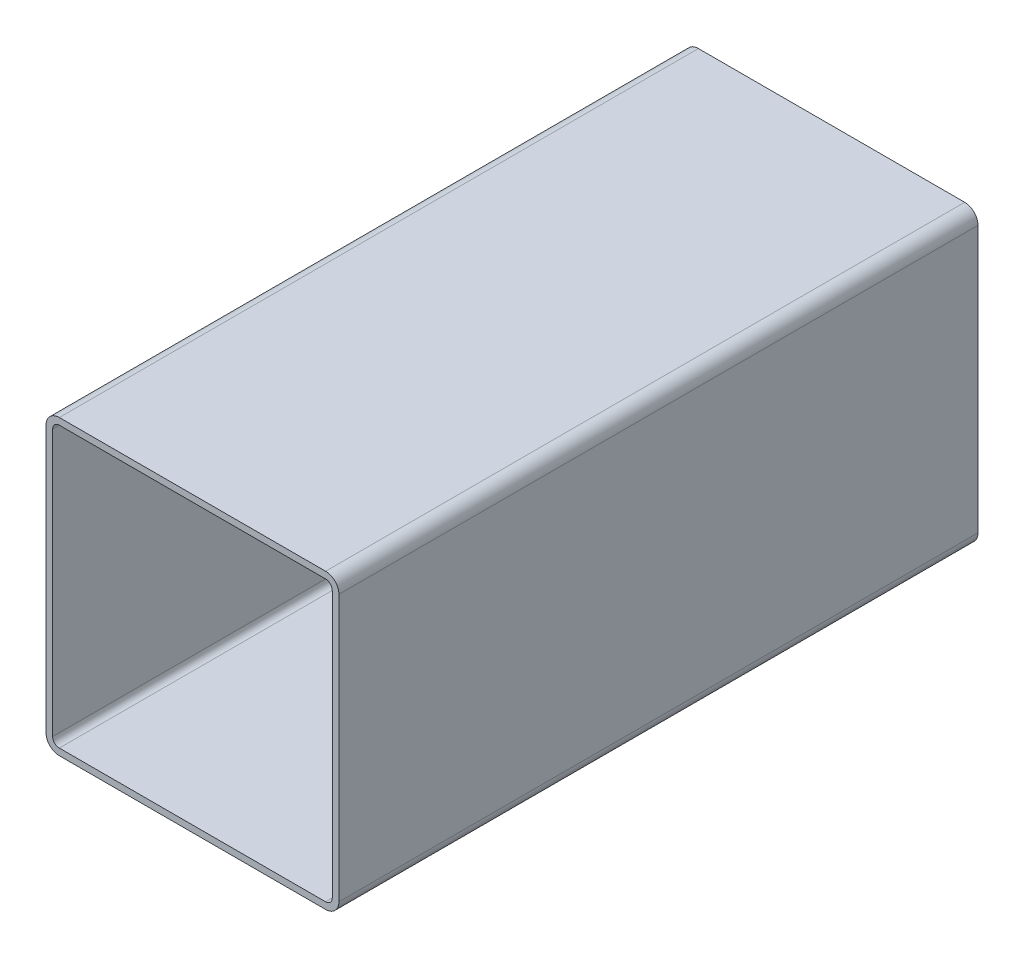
ISO-10303-21;
HEADER;
FILE_DESCRIPTION(('STEP AP214'),'2;1');
FILE_NAME('part.step','',(''),(''),'','','');
FILE_SCHEMA(('AUTOMOTIVE_DESIGN { 1 0 10303 214 1 1 1 1 }'));
ENDSEC;
DATA;
#1=APPLICATION_CONTEXT('core data for automotive mechanical design processes');
#2=APPLICATION_PROTOCOL_DEFINITION('international standard','automotive_design',2000,#1);
#3=PRODUCT_CONTEXT('',#1,'mechanical');
#4=PRODUCT('Part','Part','',(#3));
#5=PRODUCT_RELATED_PRODUCT_CATEGORY('part','',(#4));
#6=PRODUCT_DEFINITION_FORMATION('','',#4);
#7=PRODUCT_DEFINITION_CONTEXT('part definition',#1,'design');
#8=PRODUCT_DEFINITION('design','',#6,#7);
#9=PRODUCT_DEFINITION_SHAPE('','',#8);
#10=(LENGTH_UNIT() NAMED_UNIT(*) SI_UNIT(.MILLI.,.METRE.));
#11=(NAMED_UNIT(*) PLANE_ANGLE_UNIT() SI_UNIT($,.RADIAN.));
#12=(NAMED_UNIT(*) SI_UNIT($,.STERADIAN.) SOLID_ANGLE_UNIT());
#13=UNCERTAINTY_MEASURE_WITH_UNIT(LENGTH_MEASURE(1.E-05),#10,'distance_accuracy_value','');
#14=(GEOMETRIC_REPRESENTATION_CONTEXT(3) GLOBAL_UNCERTAINTY_ASSIGNED_CONTEXT((#13)) GLOBAL_UNIT_ASSIGNED_CONTEXT((#10,
#11,#12)) REPRESENTATION_CONTEXT('',''));
#15=CARTESIAN_POINT('',(0.,0.,0.));
#16=DIRECTION('',(0.,0.,1.));
#17=DIRECTION('',(1.,0.,0.));
#18=AXIS2_PLACEMENT_3D('',#15,#16,#17);
#19=CARTESIAN_POINT('',(6.80427050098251,134.105693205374,304.8));
#20=DIRECTION('',(0.,0.,1.));
#21=DIRECTION('',(1.,0.,0.));
#22=AXIS2_PLACEMENT_3D('',#19,#20,#21);
#23=PLANE('',#22);
#24=CARTESIAN_POINT('',(6.80427050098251,134.105693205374,304.8));
#25=DIRECTION('',(0.,0.,1.));
#26=DIRECTION('',(1.,0.,0.));
#27=AXIS2_PLACEMENT_3D('',#24,#25,#26);
#28=CIRCLE('',#27,6.35000000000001);
#29=CARTESIAN_POINT('',(6.80427050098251,140.455693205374,304.8));
#30=VERTEX_POINT('',#29);
#31=CARTESIAN_POINT('',(0.454270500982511,134.105693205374,304.8));
#32=VERTEX_POINT('',#31);
#33=EDGE_CURVE('E211',#30,#32,#28,.T.);
#34=ORIENTED_EDGE('',*,*,#33,.T.);
#35=DIRECTION('',(0.,-1.,0.));
#36=VECTOR('',#35,1.);
#37=CARTESIAN_POINT('',(0.454270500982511,7.10569320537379,304.8));
#38=LINE('',#37,#36);
#39=CARTESIAN_POINT('',(0.45427050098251,7.1056932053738,304.8));
#40=VERTEX_POINT('',#39);
#41=EDGE_CURVE('E214',#32,#40,#38,.T.);
#42=ORIENTED_EDGE('',*,*,#41,.T.);
#43=CARTESIAN_POINT('',(6.80427050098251,7.1056932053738,304.8));
#44=DIRECTION('',(0.,0.,1.));
#45=DIRECTION('',(1.,0.,0.));
#46=AXIS2_PLACEMENT_3D('',#43,#44,#45);
#47=CIRCLE('',#46,6.35);
#48=CARTESIAN_POINT('',(6.80427050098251,0.755693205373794,304.8));
#49=VERTEX_POINT('',#48);
#50=EDGE_CURVE('E217',#40,#49,#47,.T.);
#51=ORIENTED_EDGE('',*,*,#50,.T.);
#52=DIRECTION('',(1.,0.,0.));
#53=VECTOR('',#52,1.);
#54=CARTESIAN_POINT('',(133.804270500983,0.755693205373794,304.8));
#55=LINE('',#54,#53);
#56=CARTESIAN_POINT('',(133.804270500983,0.755693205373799,304.8));
#57=VERTEX_POINT('',#56);
#58=EDGE_CURVE('E219',#49,#57,#55,.T.);
#59=ORIENTED_EDGE('',*,*,#58,.T.);
#60=CARTESIAN_POINT('',(133.804270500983,7.1056932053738,304.8));
#61=DIRECTION('',(0.,0.,1.));
#62=DIRECTION('',(1.,0.,0.));
#63=AXIS2_PLACEMENT_3D('',#60,#61,#62);
#64=CIRCLE('',#63,6.35);
#65=CARTESIAN_POINT('',(140.154270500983,7.10569320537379,304.8));
#66=VERTEX_POINT('',#65);
#67=EDGE_CURVE('E221',#57,#66,#64,.T.);
#68=ORIENTED_EDGE('',*,*,#67,.T.);
#69=DIRECTION('',(0.,1.,0.));
#70=VECTOR('',#69,1.);
#71=CARTESIAN_POINT('',(140.154270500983,134.105693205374,304.8));
#72=LINE('',#71,#70);
#73=CARTESIAN_POINT('',(140.154270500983,134.105693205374,304.8));
#74=VERTEX_POINT('',#73);
#75=EDGE_CURVE('E223',#66,#74,#72,.T.);
#76=ORIENTED_EDGE('',*,*,#75,.T.);
#77=CARTESIAN_POINT('',(133.804270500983,134.105693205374,304.8));
#78=DIRECTION('',(0.,0.,1.));
#79=DIRECTION('',(1.,0.,0.));
#80=AXIS2_PLACEMENT_3D('',#77,#78,#79);
#81=CIRCLE('',#80,6.35000000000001);
#82=CARTESIAN_POINT('',(133.804270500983,140.455693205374,304.8));
#83=VERTEX_POINT('',#82);
#84=EDGE_CURVE('E225',#74,#83,#81,.T.);
#85=ORIENTED_EDGE('',*,*,#84,.T.);
#86=DIRECTION('',(-1.,0.,0.));
#87=VECTOR('',#86,1.);
#88=CARTESIAN_POINT('',(6.80427050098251,140.455693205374,304.8));
#89=LINE('',#88,#87);
#90=EDGE_CURVE('E227',#83,#30,#89,.T.);
#91=ORIENTED_EDGE('',*,*,#90,.T.);
#92=EDGE_LOOP('',(#34,#42,#51,#59,#68,#76,#85,#91));
#93=FACE_BOUND('',#92,.T.);
#94=DIRECTION('',(0.,-1.,0.));
#95=VECTOR('',#94,1.);
#96=CARTESIAN_POINT('',(3.62927050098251,7.10569320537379,304.8));
#97=LINE('',#96,#95);
#98=CARTESIAN_POINT('',(3.62927050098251,134.105693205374,304.8));
#99=VERTEX_POINT('',#98);
#100=CARTESIAN_POINT('',(3.62927050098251,7.10569320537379,304.8));
#101=VERTEX_POINT('',#100);
#102=EDGE_CURVE('E154',#99,#101,#97,.T.);
#103=ORIENTED_EDGE('',*,*,#102,.F.);
#104=CARTESIAN_POINT('',(6.80427050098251,134.105693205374,304.8));
#105=DIRECTION('',(0.,0.,1.));
#106=DIRECTION('',(1.,0.,0.));
#107=AXIS2_PLACEMENT_3D('',#104,#105,#106);
#108=CIRCLE('',#107,3.17500000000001);
#109=CARTESIAN_POINT('',(6.80427050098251,137.280693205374,304.8));
#110=VERTEX_POINT('',#109);
#111=EDGE_CURVE('E146',#110,#99,#108,.T.);
#112=ORIENTED_EDGE('',*,*,#111,.F.);
#113=DIRECTION('',(-1.,0.,0.));
#114=VECTOR('',#113,1.);
#115=CARTESIAN_POINT('',(6.80427050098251,137.280693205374,304.8));
#116=LINE('',#115,#114);
#117=CARTESIAN_POINT('',(133.804270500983,137.280693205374,304.8));
#118=VERTEX_POINT('',#117);
#119=EDGE_CURVE('E179',#118,#110,#116,.T.);
#120=ORIENTED_EDGE('',*,*,#119,.F.);
#121=CARTESIAN_POINT('',(133.804270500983,134.105693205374,304.8));
#122=DIRECTION('',(0.,0.,1.));
#123=DIRECTION('',(1.,0.,0.));
#124=AXIS2_PLACEMENT_3D('',#121,#122,#123);
#125=CIRCLE('',#124,3.175);
#126=CARTESIAN_POINT('',(136.979270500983,134.105693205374,304.8));
#127=VERTEX_POINT('',#126);
#128=EDGE_CURVE('E177',#127,#118,#125,.T.);
#129=ORIENTED_EDGE('',*,*,#128,.F.);
#130=DIRECTION('',(0.,1.,0.));
#131=VECTOR('',#130,1.);
#132=CARTESIAN_POINT('',(136.979270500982,134.105693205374,304.8));
#133=LINE('',#132,#131);
#134=CARTESIAN_POINT('',(136.979270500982,7.10569320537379,304.8));
#135=VERTEX_POINT('',#134);
#136=EDGE_CURVE('E175',#135,#127,#133,.T.);
#137=ORIENTED_EDGE('',*,*,#136,.F.);
#138=CARTESIAN_POINT('',(133.804270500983,7.1056932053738,304.8));
#139=DIRECTION('',(0.,0.,1.));
#140=DIRECTION('',(1.,0.,0.));
#141=AXIS2_PLACEMENT_3D('',#138,#139,#140);
#142=CIRCLE('',#141,3.17499999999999);
#143=CARTESIAN_POINT('',(133.804270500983,3.9306932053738,304.8));
#144=VERTEX_POINT('',#143);
#145=EDGE_CURVE('E173',#144,#135,#142,.T.);
#146=ORIENTED_EDGE('',*,*,#145,.F.);
#147=DIRECTION('',(1.,0.,0.));
#148=VECTOR('',#147,1.);
#149=CARTESIAN_POINT('',(133.804270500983,3.93069320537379,304.8));
#150=LINE('',#149,#148);
#151=CARTESIAN_POINT('',(6.80427050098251,3.93069320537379,304.8));
#152=VERTEX_POINT('',#151);
#153=EDGE_CURVE('E169',#152,#144,#150,.T.);
#154=ORIENTED_EDGE('',*,*,#153,.F.);
#155=CARTESIAN_POINT('',(6.80427050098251,7.1056932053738,304.8));
#156=DIRECTION('',(0.,0.,1.));
#157=DIRECTION('',(1.,0.,0.));
#158=AXIS2_PLACEMENT_3D('',#155,#156,#157);
#159=CIRCLE('',#158,3.175);
#160=EDGE_CURVE('E167',#101,#152,#159,.T.);
#161=ORIENTED_EDGE('',*,*,#160,.F.);
#162=EDGE_LOOP('',(#103,#112,#120,#129,#137,#146,#154,#161));
#163=FACE_BOUND('',#162,.T.);
#164=ADVANCED_FACE('F33',(#93,#163),#23,.T.);
#165=CARTESIAN_POINT('',(6.80427050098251,134.105693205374,0.));
#166=DIRECTION('',(0.,0.,1.));
#167=DIRECTION('',(1.,0.,0.));
#168=AXIS2_PLACEMENT_3D('',#165,#166,#167);
#169=PLANE('',#168);
#170=CARTESIAN_POINT('',(6.80427050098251,134.105693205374,0.));
#171=DIRECTION('',(0.,0.,1.));
#172=DIRECTION('',(1.,0.,0.));
#173=AXIS2_PLACEMENT_3D('',#170,#171,#172);
#174=CIRCLE('',#173,6.35000000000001);
#175=CARTESIAN_POINT('',(6.80427050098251,140.455693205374,0.));
#176=VERTEX_POINT('',#175);
#177=CARTESIAN_POINT('',(0.454270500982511,134.105693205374,0.));
#178=VERTEX_POINT('',#177);
#179=EDGE_CURVE('E162',#176,#178,#174,.T.);
#180=ORIENTED_EDGE('',*,*,#179,.F.);
#181=DIRECTION('',(-1.,0.,0.));
#182=VECTOR('',#181,1.);
#183=CARTESIAN_POINT('',(6.80427050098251,140.455693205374,0.));
#184=LINE('',#183,#182);
#185=CARTESIAN_POINT('',(133.804270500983,140.455693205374,0.));
#186=VERTEX_POINT('',#185);
#187=EDGE_CURVE('E215',#186,#176,#184,.T.);
#188=ORIENTED_EDGE('',*,*,#187,.F.);
#189=CARTESIAN_POINT('',(133.804270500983,134.105693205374,0.));
#190=DIRECTION('',(0.,0.,1.));
#191=DIRECTION('',(1.,0.,0.));
#192=AXIS2_PLACEMENT_3D('',#189,#190,#191);
#193=CIRCLE('',#192,6.35000000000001);
#194=CARTESIAN_POINT('',(140.154270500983,134.105693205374,0.));
#195=VERTEX_POINT('',#194);
#196=EDGE_CURVE('E242',#195,#186,#193,.T.);
#197=ORIENTED_EDGE('',*,*,#196,.F.);
#198=DIRECTION('',(0.,1.,0.));
#199=VECTOR('',#198,1.);
#200=CARTESIAN_POINT('',(140.154270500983,134.105693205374,0.));
#201=LINE('',#200,#199);
#202=CARTESIAN_POINT('',(140.154270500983,7.10569320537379,0.));
#203=VERTEX_POINT('',#202);
#204=EDGE_CURVE('E240',#203,#195,#201,.T.);
#205=ORIENTED_EDGE('',*,*,#204,.F.);
#206=CARTESIAN_POINT('',(133.804270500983,7.1056932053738,0.));
#207=DIRECTION('',(0.,0.,1.));
#208=DIRECTION('',(1.,0.,0.));
#209=AXIS2_PLACEMENT_3D('',#206,#207,#208);
#210=CIRCLE('',#209,6.35);
#211=CARTESIAN_POINT('',(133.804270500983,0.755693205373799,0.));
#212=VERTEX_POINT('',#211);
#213=EDGE_CURVE('E238',#212,#203,#210,.T.);
#214=ORIENTED_EDGE('',*,*,#213,.F.);
#215=DIRECTION('',(1.,0.,0.));
#216=VECTOR('',#215,1.);
#217=CARTESIAN_POINT('',(133.804270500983,0.755693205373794,0.));
#218=LINE('',#217,#216);
#219=CARTESIAN_POINT('',(6.80427050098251,0.755693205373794,0.));
#220=VERTEX_POINT('',#219);
#221=EDGE_CURVE('E236',#220,#212,#218,.T.);
#222=ORIENTED_EDGE('',*,*,#221,.F.);
#223=CARTESIAN_POINT('',(6.80427050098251,7.1056932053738,0.));
#224=DIRECTION('',(0.,0.,1.));
#225=DIRECTION('',(1.,0.,0.));
#226=AXIS2_PLACEMENT_3D('',#223,#224,#225);
#227=CIRCLE('',#226,6.35);
#228=CARTESIAN_POINT('',(0.45427050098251,7.1056932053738,0.));
#229=VERTEX_POINT('',#228);
#230=EDGE_CURVE('E234',#229,#220,#227,.T.);
#231=ORIENTED_EDGE('',*,*,#230,.F.);
#232=DIRECTION('',(0.,-1.,0.));
#233=VECTOR('',#232,1.);
#234=CARTESIAN_POINT('',(0.454270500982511,7.10569320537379,0.));
#235=LINE('',#234,#233);
#236=EDGE_CURVE('E232',#178,#229,#235,.T.);
#237=ORIENTED_EDGE('',*,*,#236,.F.);
#238=EDGE_LOOP('',(#180,#188,#197,#205,#214,#222,#231,#237));
#239=FACE_BOUND('',#238,.T.);
#240=CARTESIAN_POINT('',(6.80427050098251,134.105693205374,0.));
#241=DIRECTION('',(0.,0.,1.));
#242=DIRECTION('',(1.,0.,0.));
#243=AXIS2_PLACEMENT_3D('',#240,#241,#242);
#244=CIRCLE('',#243,3.17500000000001);
#245=CARTESIAN_POINT('',(6.80427050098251,137.280693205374,0.));
#246=VERTEX_POINT('',#245);
#247=CARTESIAN_POINT('',(3.62927050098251,134.105693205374,0.));
#248=VERTEX_POINT('',#247);
#249=EDGE_CURVE('E56',#246,#248,#244,.T.);
#250=ORIENTED_EDGE('',*,*,#249,.T.);
#251=DIRECTION('',(0.,-1.,0.));
#252=VECTOR('',#251,1.);
#253=CARTESIAN_POINT('',(3.62927050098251,7.10569320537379,0.));
#254=LINE('',#253,#252);
#255=CARTESIAN_POINT('',(3.62927050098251,7.10569320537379,0.));
#256=VERTEX_POINT('',#255);
#257=EDGE_CURVE('E161',#248,#256,#254,.T.);
#258=ORIENTED_EDGE('',*,*,#257,.T.);
#259=CARTESIAN_POINT('',(6.80427050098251,7.1056932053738,0.));
#260=DIRECTION('',(0.,0.,1.));
#261=DIRECTION('',(1.,0.,0.));
#262=AXIS2_PLACEMENT_3D('',#259,#260,#261);
#263=CIRCLE('',#262,3.175);
#264=CARTESIAN_POINT('',(6.80427050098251,3.93069320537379,0.));
#265=VERTEX_POINT('',#264);
#266=EDGE_CURVE('E183',#256,#265,#263,.T.);
#267=ORIENTED_EDGE('',*,*,#266,.T.);
#268=DIRECTION('',(1.,0.,0.));
#269=VECTOR('',#268,1.);
#270=CARTESIAN_POINT('',(133.804270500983,3.93069320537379,0.));
#271=LINE('',#270,#269);
#272=CARTESIAN_POINT('',(133.804270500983,3.9306932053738,0.));
#273=VERTEX_POINT('',#272);
#274=EDGE_CURVE('E186',#265,#273,#271,.T.);
#275=ORIENTED_EDGE('',*,*,#274,.T.);
#276=CARTESIAN_POINT('',(133.804270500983,7.1056932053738,0.));
#277=DIRECTION('',(0.,0.,1.));
#278=DIRECTION('',(1.,0.,0.));
#279=AXIS2_PLACEMENT_3D('',#276,#277,#278);
#280=CIRCLE('',#279,3.17499999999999);
#281=CARTESIAN_POINT('',(136.979270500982,7.10569320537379,0.));
#282=VERTEX_POINT('',#281);
#283=EDGE_CURVE('E189',#273,#282,#280,.T.);
#284=ORIENTED_EDGE('',*,*,#283,.T.);
#285=DIRECTION('',(0.,1.,0.));
#286=VECTOR('',#285,1.);
#287=CARTESIAN_POINT('',(136.979270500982,134.105693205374,0.));
#288=LINE('',#287,#286);
#289=CARTESIAN_POINT('',(136.979270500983,134.105693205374,0.));
#290=VERTEX_POINT('',#289);
#291=EDGE_CURVE('E192',#282,#290,#288,.T.);
#292=ORIENTED_EDGE('',*,*,#291,.T.);
#293=CARTESIAN_POINT('',(133.804270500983,134.105693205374,0.));
#294=DIRECTION('',(0.,0.,1.));
#295=DIRECTION('',(1.,0.,0.));
#296=AXIS2_PLACEMENT_3D('',#293,#294,#295);
#297=CIRCLE('',#296,3.175);
#298=CARTESIAN_POINT('',(133.804270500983,137.280693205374,0.));
#299=VERTEX_POINT('',#298);
#300=EDGE_CURVE('E195',#290,#299,#297,.T.);
#301=ORIENTED_EDGE('',*,*,#300,.T.);
#302=DIRECTION('',(-1.,0.,0.));
#303=VECTOR('',#302,1.);
#304=CARTESIAN_POINT('',(6.80427050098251,137.280693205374,0.));
#305=LINE('',#304,#303);
#306=EDGE_CURVE('E155',#299,#246,#305,.T.);
#307=ORIENTED_EDGE('',*,*,#306,.T.);
#308=EDGE_LOOP('',(#250,#258,#267,#275,#284,#292,#301,#307));
#309=FACE_BOUND('',#308,.T.);
#310=ADVANCED_FACE('F272',(#239,#309),#169,.F.);
#311=CARTESIAN_POINT('',(6.80427050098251,134.105693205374,304.8));
#312=DIRECTION('',(0.,0.,-1.));
#313=DIRECTION('',(-1.,0.,0.));
#314=AXIS2_PLACEMENT_3D('',#311,#312,#313);
#315=CYLINDRICAL_SURFACE('',#314,6.35000000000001);
#316=ORIENTED_EDGE('',*,*,#179,.T.);
#317=DIRECTION('',(0.,0.,-1.));
#318=VECTOR('',#317,1.);
#319=CARTESIAN_POINT('',(0.454270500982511,134.105693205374,304.8));
#320=LINE('',#319,#318);
#321=EDGE_CURVE('E11',#32,#178,#320,.T.);
#322=ORIENTED_EDGE('',*,*,#321,.F.);
#323=ORIENTED_EDGE('',*,*,#33,.F.);
#324=DIRECTION('',(0.,0.,-1.));
#325=VECTOR('',#324,1.);
#326=CARTESIAN_POINT('',(6.80427050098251,140.455693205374,304.8));
#327=LINE('',#326,#325);
#328=EDGE_CURVE('E229',#30,#176,#327,.T.);
#329=ORIENTED_EDGE('',*,*,#328,.T.);
#330=EDGE_LOOP('',(#316,#322,#323,#329));
#331=FACE_BOUND('',#330,.T.);
#332=ADVANCED_FACE('F35',(#331),#315,.T.);
#333=CARTESIAN_POINT('',(0.454270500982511,7.10569320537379,304.8));
#334=DIRECTION('',(1.,0.,0.));
#335=DIRECTION('',(0.,0.,-1.));
#336=AXIS2_PLACEMENT_3D('',#333,#334,#335);
#337=PLANE('',#336);
#338=ORIENTED_EDGE('',*,*,#236,.T.);
#339=DIRECTION('',(0.,0.,-1.));
#340=VECTOR('',#339,1.);
#341=CARTESIAN_POINT('',(0.45427050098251,7.1056932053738,304.8));
#342=LINE('',#341,#340);
#343=EDGE_CURVE('E41',#40,#229,#342,.T.);
#344=ORIENTED_EDGE('',*,*,#343,.F.);
#345=ORIENTED_EDGE('',*,*,#41,.F.);
#346=ORIENTED_EDGE('',*,*,#321,.T.);
#347=EDGE_LOOP('',(#338,#344,#345,#346));
#348=FACE_BOUND('',#347,.T.);
#349=ADVANCED_FACE('F289',(#348),#337,.F.);
#350=CARTESIAN_POINT('',(6.80427050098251,7.1056932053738,304.8));
#351=DIRECTION('',(0.,0.,-1.));
#352=DIRECTION('',(-1.,0.,0.));
#353=AXIS2_PLACEMENT_3D('',#350,#351,#352);
#354=CYLINDRICAL_SURFACE('',#353,6.35);
#355=ORIENTED_EDGE('',*,*,#230,.T.);
#356=DIRECTION('',(0.,0.,-1.));
#357=VECTOR('',#356,1.);
#358=CARTESIAN_POINT('',(6.80427050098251,0.755693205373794,304.8));
#359=LINE('',#358,#357);
#360=EDGE_CURVE('E259',#49,#220,#359,.T.);
#361=ORIENTED_EDGE('',*,*,#360,.F.);
#362=ORIENTED_EDGE('',*,*,#50,.F.);
#363=ORIENTED_EDGE('',*,*,#343,.T.);
#364=EDGE_LOOP('',(#355,#361,#362,#363));
#365=FACE_BOUND('',#364,.T.);
#366=ADVANCED_FACE('F266',(#365),#354,.T.);
#367=CARTESIAN_POINT('',(133.804270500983,0.755693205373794,304.8));
#368=DIRECTION('',(0.,1.,0.));
#369=DIRECTION('',(0.,0.,1.));
#370=AXIS2_PLACEMENT_3D('',#367,#368,#369);
#371=PLANE('',#370);
#372=ORIENTED_EDGE('',*,*,#221,.T.);
#373=DIRECTION('',(0.,0.,-1.));
#374=VECTOR('',#373,1.);
#375=CARTESIAN_POINT('',(133.804270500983,0.755693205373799,304.8));
#376=LINE('',#375,#374);
#377=EDGE_CURVE('E256',#57,#212,#376,.T.);
#378=ORIENTED_EDGE('',*,*,#377,.F.);
#379=ORIENTED_EDGE('',*,*,#58,.F.);
#380=ORIENTED_EDGE('',*,*,#360,.T.);
#381=EDGE_LOOP('',(#372,#378,#379,#380));
#382=FACE_BOUND('',#381,.T.);
#383=ADVANCED_FACE('F278',(#382),#371,.F.);
#384=CARTESIAN_POINT('',(133.804270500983,7.1056932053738,304.8));
#385=DIRECTION('',(0.,0.,-1.));
#386=DIRECTION('',(-1.,0.,0.));
#387=AXIS2_PLACEMENT_3D('',#384,#385,#386);
#388=CYLINDRICAL_SURFACE('',#387,6.35);
#389=ORIENTED_EDGE('',*,*,#213,.T.);
#390=DIRECTION('',(0.,0.,-1.));
#391=VECTOR('',#390,1.);
#392=CARTESIAN_POINT('',(140.154270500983,7.10569320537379,304.8));
#393=LINE('',#392,#391);
#394=EDGE_CURVE('E253',#66,#203,#393,.T.);
#395=ORIENTED_EDGE('',*,*,#394,.F.);
#396=ORIENTED_EDGE('',*,*,#67,.F.);
#397=ORIENTED_EDGE('',*,*,#377,.T.);
#398=EDGE_LOOP('',(#389,#395,#396,#397));
#399=FACE_BOUND('',#398,.T.);
#400=ADVANCED_FACE('F282',(#399),#388,.T.);
#401=CARTESIAN_POINT('',(140.154270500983,134.105693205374,304.8));
#402=DIRECTION('',(-1.,0.,0.));
#403=DIRECTION('',(0.,0.,1.));
#404=AXIS2_PLACEMENT_3D('',#401,#402,#403);
#405=PLANE('',#404);
#406=ORIENTED_EDGE('',*,*,#204,.T.);
#407=DIRECTION('',(0.,0.,-1.));
#408=VECTOR('',#407,1.);
#409=CARTESIAN_POINT('',(140.154270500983,134.105693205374,304.8));
#410=LINE('',#409,#408);
#411=EDGE_CURVE('E250',#74,#195,#410,.T.);
#412=ORIENTED_EDGE('',*,*,#411,.F.);
#413=ORIENTED_EDGE('',*,*,#75,.F.);
#414=ORIENTED_EDGE('',*,*,#394,.T.);
#415=EDGE_LOOP('',(#406,#412,#413,#414));
#416=FACE_BOUND('',#415,.T.);
#417=ADVANCED_FACE('F302',(#416),#405,.F.);
#418=CARTESIAN_POINT('',(133.804270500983,134.105693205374,304.8));
#419=DIRECTION('',(0.,0.,-1.));
#420=DIRECTION('',(-1.,0.,0.));
#421=AXIS2_PLACEMENT_3D('',#418,#419,#420);
#422=CYLINDRICAL_SURFACE('',#421,6.35000000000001);
#423=ORIENTED_EDGE('',*,*,#196,.T.);
#424=DIRECTION('',(0.,0.,-1.));
#425=VECTOR('',#424,1.);
#426=CARTESIAN_POINT('',(133.804270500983,140.455693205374,304.8));
#427=LINE('',#426,#425);
#428=EDGE_CURVE('E247',#83,#186,#427,.T.);
#429=ORIENTED_EDGE('',*,*,#428,.F.);
#430=ORIENTED_EDGE('',*,*,#84,.F.);
#431=ORIENTED_EDGE('',*,*,#411,.T.);
#432=EDGE_LOOP('',(#423,#429,#430,#431));
#433=FACE_BOUND('',#432,.T.);
#434=ADVANCED_FACE('F300',(#433),#422,.T.);
#435=CARTESIAN_POINT('',(6.80427050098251,140.455693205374,304.8));
#436=DIRECTION('',(0.,-1.,0.));
#437=DIRECTION('',(0.,0.,-1.));
#438=AXIS2_PLACEMENT_3D('',#435,#436,#437);
#439=PLANE('',#438);
#440=ORIENTED_EDGE('',*,*,#187,.T.);
#441=ORIENTED_EDGE('',*,*,#328,.F.);
#442=ORIENTED_EDGE('',*,*,#90,.F.);
#443=ORIENTED_EDGE('',*,*,#428,.T.);
#444=EDGE_LOOP('',(#440,#441,#442,#443));
#445=FACE_BOUND('',#444,.T.);
#446=ADVANCED_FACE('F295',(#445),#439,.F.);
#447=CARTESIAN_POINT('',(6.80427050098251,134.105693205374,304.8));
#448=DIRECTION('',(0.,0.,-1.));
#449=DIRECTION('',(-1.,0.,0.));
#450=AXIS2_PLACEMENT_3D('',#447,#448,#449);
#451=CYLINDRICAL_SURFACE('',#450,3.17500000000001);
#452=ORIENTED_EDGE('',*,*,#249,.F.);
#453=DIRECTION('',(0.,0.,-1.));
#454=VECTOR('',#453,1.);
#455=CARTESIAN_POINT('',(6.80427050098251,137.280693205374,304.8));
#456=LINE('',#455,#454);
#457=EDGE_CURVE('E150',#110,#246,#456,.T.);
#458=ORIENTED_EDGE('',*,*,#457,.F.);
#459=ORIENTED_EDGE('',*,*,#111,.T.);
#460=DIRECTION('',(0.,0.,-1.));
#461=VECTOR('',#460,1.);
#462=CARTESIAN_POINT('',(3.62927050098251,134.105693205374,304.8));
#463=LINE('',#462,#461);
#464=EDGE_CURVE('E149',#99,#248,#463,.T.);
#465=ORIENTED_EDGE('',*,*,#464,.T.);
#466=EDGE_LOOP('',(#452,#458,#459,#465));
#467=FACE_BOUND('',#466,.T.);
#468=ADVANCED_FACE('F148',(#467),#451,.F.);
#469=CARTESIAN_POINT('',(3.62927050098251,7.10569320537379,304.8));
#470=DIRECTION('',(1.,0.,0.));
#471=DIRECTION('',(0.,0.,-1.));
#472=AXIS2_PLACEMENT_3D('',#469,#470,#471);
#473=PLANE('',#472);
#474=ORIENTED_EDGE('',*,*,#257,.F.);
#475=ORIENTED_EDGE('',*,*,#464,.F.);
#476=ORIENTED_EDGE('',*,*,#102,.T.);
#477=DIRECTION('',(0.,0.,-1.));
#478=VECTOR('',#477,1.);
#479=CARTESIAN_POINT('',(3.62927050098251,7.10569320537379,304.8));
#480=LINE('',#479,#478);
#481=EDGE_CURVE('E163',#101,#256,#480,.T.);
#482=ORIENTED_EDGE('',*,*,#481,.T.);
#483=EDGE_LOOP('',(#474,#475,#476,#482));
#484=FACE_BOUND('',#483,.T.);
#485=ADVANCED_FACE('F158',(#484),#473,.T.);
#486=CARTESIAN_POINT('',(6.80427050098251,7.1056932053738,304.8));
#487=DIRECTION('',(0.,0.,-1.));
#488=DIRECTION('',(-1.,0.,0.));
#489=AXIS2_PLACEMENT_3D('',#486,#487,#488);
#490=CYLINDRICAL_SURFACE('',#489,3.175);
#491=ORIENTED_EDGE('',*,*,#266,.F.);
#492=ORIENTED_EDGE('',*,*,#481,.F.);
#493=ORIENTED_EDGE('',*,*,#160,.T.);
#494=DIRECTION('',(0.,0.,-1.));
#495=VECTOR('',#494,1.);
#496=CARTESIAN_POINT('',(6.80427050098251,3.93069320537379,304.8));
#497=LINE('',#496,#495);
#498=EDGE_CURVE('E208',#152,#265,#497,.T.);
#499=ORIENTED_EDGE('',*,*,#498,.T.);
#500=EDGE_LOOP('',(#491,#492,#493,#499));
#501=FACE_BOUND('',#500,.T.);
#502=ADVANCED_FACE('F327',(#501),#490,.F.);
#503=CARTESIAN_POINT('',(133.804270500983,3.93069320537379,304.8));
#504=DIRECTION('',(0.,1.,0.));
#505=DIRECTION('',(0.,0.,1.));
#506=AXIS2_PLACEMENT_3D('',#503,#504,#505);
#507=PLANE('',#506);
#508=ORIENTED_EDGE('',*,*,#274,.F.);
#509=ORIENTED_EDGE('',*,*,#498,.F.);
#510=ORIENTED_EDGE('',*,*,#153,.T.);
#511=DIRECTION('',(0.,0.,-1.));
#512=VECTOR('',#511,1.);
#513=CARTESIAN_POINT('',(133.804270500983,3.9306932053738,304.8));
#514=LINE('',#513,#512);
#515=EDGE_CURVE('E206',#144,#273,#514,.T.);
#516=ORIENTED_EDGE('',*,*,#515,.T.);
#517=EDGE_LOOP('',(#508,#509,#510,#516));
#518=FACE_BOUND('',#517,.T.);
#519=ADVANCED_FACE('F331',(#518),#507,.T.);
#520=CARTESIAN_POINT('',(133.804270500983,7.1056932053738,304.8));
#521=DIRECTION('',(0.,0.,-1.));
#522=DIRECTION('',(-1.,0.,0.));
#523=AXIS2_PLACEMENT_3D('',#520,#521,#522);
#524=CYLINDRICAL_SURFACE('',#523,3.17499999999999);
#525=ORIENTED_EDGE('',*,*,#283,.F.);
#526=ORIENTED_EDGE('',*,*,#515,.F.);
#527=ORIENTED_EDGE('',*,*,#145,.T.);
#528=DIRECTION('',(0.,0.,-1.));
#529=VECTOR('',#528,1.);
#530=CARTESIAN_POINT('',(136.979270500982,7.10569320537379,304.8));
#531=LINE('',#530,#529);
#532=EDGE_CURVE('E204',#135,#282,#531,.T.);
#533=ORIENTED_EDGE('',*,*,#532,.T.);
#534=EDGE_LOOP('',(#525,#526,#527,#533));
#535=FACE_BOUND('',#534,.T.);
#536=ADVANCED_FACE('F337',(#535),#524,.F.);
#537=CARTESIAN_POINT('',(136.979270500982,134.105693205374,304.8));
#538=DIRECTION('',(-1.,0.,0.));
#539=DIRECTION('',(0.,0.,1.));
#540=AXIS2_PLACEMENT_3D('',#537,#538,#539);
#541=PLANE('',#540);
#542=ORIENTED_EDGE('',*,*,#291,.F.);
#543=ORIENTED_EDGE('',*,*,#532,.F.);
#544=ORIENTED_EDGE('',*,*,#136,.T.);
#545=DIRECTION('',(0.,0.,-1.));
#546=VECTOR('',#545,1.);
#547=CARTESIAN_POINT('',(136.979270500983,134.105693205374,304.8));
#548=LINE('',#547,#546);
#549=EDGE_CURVE('E202',#127,#290,#548,.T.);
#550=ORIENTED_EDGE('',*,*,#549,.T.);
#551=EDGE_LOOP('',(#542,#543,#544,#550));
#552=FACE_BOUND('',#551,.T.);
#553=ADVANCED_FACE('F341',(#552),#541,.T.);
#554=CARTESIAN_POINT('',(133.804270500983,134.105693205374,304.8));
#555=DIRECTION('',(0.,0.,-1.));
#556=DIRECTION('',(-1.,0.,0.));
#557=AXIS2_PLACEMENT_3D('',#554,#555,#556);
#558=CYLINDRICAL_SURFACE('',#557,3.175);
#559=ORIENTED_EDGE('',*,*,#300,.F.);
#560=ORIENTED_EDGE('',*,*,#549,.F.);
#561=ORIENTED_EDGE('',*,*,#128,.T.);
#562=DIRECTION('',(0.,0.,-1.));
#563=VECTOR('',#562,1.);
#564=CARTESIAN_POINT('',(133.804270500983,137.280693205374,304.8));
#565=LINE('',#564,#563);
#566=EDGE_CURVE('E48',#118,#299,#565,.T.);
#567=ORIENTED_EDGE('',*,*,#566,.T.);
#568=EDGE_LOOP('',(#559,#560,#561,#567));
#569=FACE_BOUND('',#568,.T.);
#570=ADVANCED_FACE('F345',(#569),#558,.F.);
#571=CARTESIAN_POINT('',(6.80427050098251,137.280693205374,304.8));
#572=DIRECTION('',(0.,-1.,0.));
#573=DIRECTION('',(0.,0.,-1.));
#574=AXIS2_PLACEMENT_3D('',#571,#572,#573);
#575=PLANE('',#574);
#576=ORIENTED_EDGE('',*,*,#306,.F.);
#577=ORIENTED_EDGE('',*,*,#566,.F.);
#578=ORIENTED_EDGE('',*,*,#119,.T.);
#579=ORIENTED_EDGE('',*,*,#457,.T.);
#580=EDGE_LOOP('',(#576,#577,#578,#579));
#581=FACE_BOUND('',#580,.T.);
#582=ADVANCED_FACE('F349',(#581),#575,.T.);
#583=CLOSED_SHELL('',(#164,#310,#332,#349,#366,#383,#400,#417,#434,#446,#468,#485,#502,#519,
#536,#553,#570,#582));
#584=MANIFOLD_SOLID_BREP('B2',#583);
#585=ADVANCED_BREP_SHAPE_REPRESENTATION('',(#18,#584),#14);
#586=SHAPE_DEFINITION_REPRESENTATION(#9,#585);
ENDSEC;
END-ISO-10303-21;
